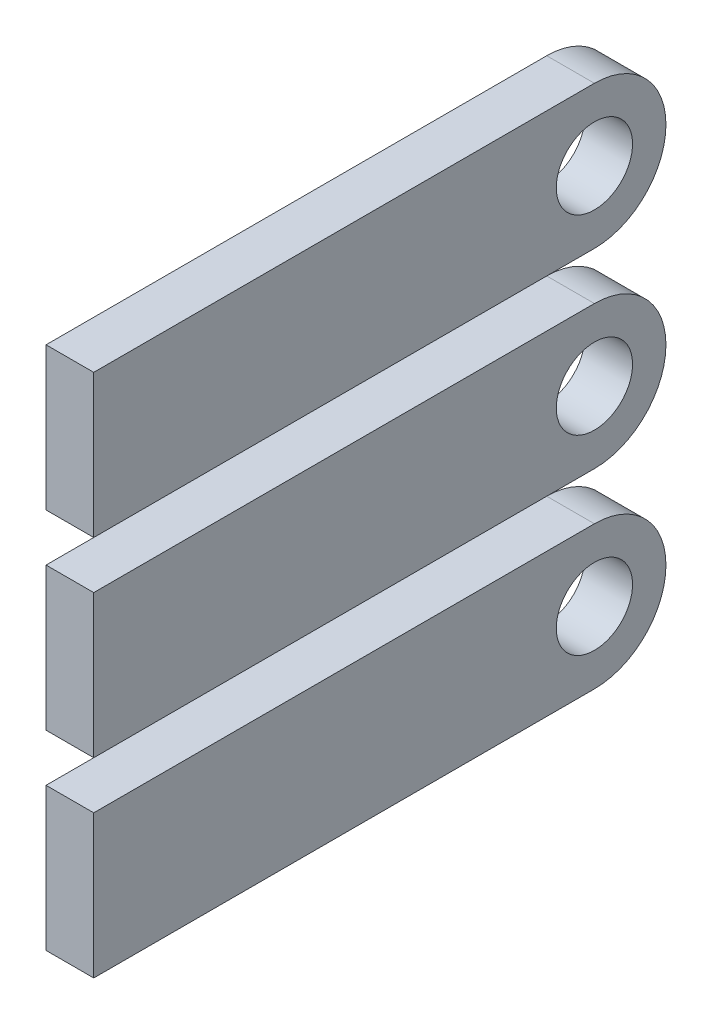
from build123d import *

# Parameters (mm, degrees)
P_IDAT_VYSUNUT_M1_DEPTH  = 85
SKICA2_R                 = 105
SKICA2_R_2               = 80.422447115
P_IDAT_VYSUNUT_M2_DEPTH  = 20
SKICA4_W                 = 5
SKICA4_H                 = 15
P_IDAT_VYSUNUT_M3_DEPTH  = 60
ODEBRAT_VYSUNUT_M2_DEPTH = 80
LINPOLE3_COUNT           = 3
LINPOLE3_PITCH           = 20
ODEBRAT_VYSUNUT_M3_DEPTH = 80
ODEBRAT_VYSUNUT_M4_DEPTH = 80
M_TKO1_SCALE             = 0.655
SKICA12_R                = 90.665078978
ODEBRAT_VYSUNUT_M5_DEPTH = 120.121794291


with BuildPart() as part:
    # Skica1 → P_idat vysunut_m1 (new body)
    with BuildSketch(Plane.XY):
        Polygon((-85.128854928, 24.715947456), (-77.052076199, 23.037958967), (-75.877811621, 26.651973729), (-83.39835976, 30.041863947), align=None)
        Polygon((-82.078990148, 33.478939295), (-74.221854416, 30.965889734), (-72.676255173, 34.437362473), (-79.801264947, 38.594793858), align=None)
        Polygon((-78.129850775, 41.875128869), (-70.578442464, 38.554551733), (-68.678442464, 41.845448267), (-75.329850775, 46.724871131), align=None)
        Polygon((-73.324704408, 49.812525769), (-66.161758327, 45.720801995), (-63.928174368, 48.795066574), (-70.033106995, 54.343020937), align=None)
        Polygon((-67.716197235, 57.204166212), (-61.02019212, 52.386125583), (-58.477495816, 55.21007592), (-63.969065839, 61.365777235), align=None)
        Polygon((-61.365777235, 63.969065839), (-55.21007592, 58.477495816), (-52.386125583, 61.02019212), (-57.204166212, 67.716197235), align=None)
        Polygon((-54.343020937, 70.033106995), (-48.795066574, 63.928174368), (-45.720801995, 66.161758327), (-49.812525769, 73.324704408), align=None)
        Polygon((-46.724871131, 75.329850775), (-41.845448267, 68.678442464), (-38.554551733, 70.578442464), (-41.875128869, 78.129850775), align=None)
        Polygon((-38.594793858, 79.801264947), (-34.437362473, 72.676255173), (-30.965889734, 74.221854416), (-33.478939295, 82.078990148), align=None)
        Polygon((-30.041863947, 83.39835976), (-26.651973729, 75.877811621), (-23.037958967, 77.052076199), (-24.715947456, 85.128854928), align=None)
        Polygon((-21.159789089, 86.081724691), (-18.574580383, 78.248034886), (-14.8576195, 79.038099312), (-15.682162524, 87.246030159), align=None)
        Polygon((-12.045883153, 87.821960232), (-10.293680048, 79.760956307), (-6.514496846, 80.158164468), (-6.476560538, 88.407319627), align=None)
        Polygon((-87.246030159, 15.682162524), (-79.038099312, 14.8576195), (-78.248034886, 18.574580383), (-86.081724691, 21.159789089), align=None)
        Polygon((-88.407319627, 6.476560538), (-80.158164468, 6.514496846), (-79.760956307, 10.293680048), (-87.821960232, 12.045883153), align=None)
        Polygon((-87.821960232, -12.045883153), (-79.760956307, -10.293680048), (-80.158164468, -6.514496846), (-88.407319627, -6.476560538), align=None)
        Polygon((-83.39835976, -30.041863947), (-75.877811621, -26.651973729), (-77.052076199, -23.037958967), (-85.128854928, -24.715947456), align=None)
        Polygon((-88.6, -2.8), (-80.4, -1.9), (-80.4, 1.9), (-88.6, 2.8), align=None)
        Polygon((-79.801264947, -38.594793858), (-72.676255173, -34.437362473), (-74.221854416, -30.965889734), (-82.078990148, -33.478939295), align=None)
        Polygon((-75.329850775, -46.724871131), (-68.678442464, -41.845448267), (-70.578442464, -38.554551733), (-78.129850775, -41.875128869), align=None)
        Polygon((-70.033106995, -54.343020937), (-63.928174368, -48.795066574), (-66.161758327, -45.720801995), (-73.324704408, -49.812525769), align=None)
        Polygon((-63.969065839, -61.365777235), (-58.477495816, -55.21007592), (-61.02019212, -52.386125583), (-67.716197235, -57.204166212), align=None)
        Polygon((-57.204166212, -67.716197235), (-52.386125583, -61.02019212), (-55.21007592, -58.477495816), (-61.365777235, -63.969065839), align=None)
        Polygon((-54.343020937, -70.033106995), (-48.795066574, -63.928174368), (-45.720801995, -66.161758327), (-49.812525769, -73.324704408), align=None)
        Polygon((-46.724871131, -75.329850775), (-41.845448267, -68.678442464), (-38.554551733, -70.578442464), (-41.875128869, -78.129850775), align=None)
        Polygon((-38.594793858, -79.801264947), (-34.437362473, -72.676255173), (-30.965889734, -74.221854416), (-33.478939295, -82.078990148), align=None)
        Polygon((-30.041863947, -83.39835976), (-26.651973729, -75.877811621), (-23.037958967, -77.052076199), (-24.715947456, -85.128854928), align=None)
        Polygon((-21.159789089, -86.081724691), (-18.574580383, -78.248034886), (-14.8576195, -79.038099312), (-15.682162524, -87.246030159), align=None)
        Polygon((-12.045883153, -87.821960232), (-10.293680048, -79.760956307), (-6.514496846, -80.158164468), (-6.476560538, -88.407319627), align=None)
        Polygon((-2.8, -88.6), (-1.9, -80.4), (1.9, -80.4), (2.8, -88.6), align=None)
        Polygon((6.476560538, -88.407319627), (6.514496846, -80.158164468), (10.293680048, -79.760956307), (12.045883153, -87.821960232), align=None)
        Polygon((15.682162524, -87.246030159), (14.8576195, -79.038099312), (18.574580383, -78.248034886), (21.159789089, -86.081724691), align=None)
        Polygon((24.715947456, -85.128854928), (23.037958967, -77.052076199), (26.651973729, -75.877811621), (30.041863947, -83.39835976), align=None)
        Polygon((33.478939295, -82.078990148), (30.965889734, -74.221854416), (34.437362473, -72.676255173), (38.594793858, -79.801264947), align=None)
        Polygon((41.875128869, -78.129850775), (38.554551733, -70.578442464), (41.845448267, -68.678442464), (46.724871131, -75.329850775), align=None)
        Polygon((49.812525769, -73.324704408), (45.720801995, -66.161758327), (48.795066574, -63.928174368), (54.343020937, -70.033106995), align=None)
        Polygon((57.204166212, -67.716197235), (52.386125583, -61.02019212), (55.21007592, -58.477495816), (61.365777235, -63.969065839), align=None)
        Polygon((63.969065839, -61.365777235), (58.477495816, -55.21007592), (61.02019212, -52.386125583), (67.716197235, -57.204166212), align=None)
        Polygon((70.033106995, -54.343020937), (63.928174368, -48.795066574), (66.161758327, -45.720801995), (73.324704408, -49.812525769), align=None)
        Polygon((75.329850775, -46.724871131), (68.678442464, -41.845448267), (70.578442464, -38.554551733), (78.129850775, -41.875128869), align=None)
        Polygon((79.801264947, -38.594793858), (72.676255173, -34.437362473), (74.221854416, -30.965889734), (82.078990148, -33.478939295), align=None)
        Polygon((83.39835976, -30.041863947), (75.877811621, -26.651973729), (77.052076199, -23.037958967), (85.128854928, -24.715947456), align=None)
        Polygon((86.081724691, -21.159789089), (78.248034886, -18.574580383), (79.038099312, -14.8576195), (87.246030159, -15.682162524), align=None)
        Polygon((87.821960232, -12.045883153), (79.760956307, -10.293680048), (80.158164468, -6.514496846), (88.407319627, -6.476560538), align=None)
        Polygon((88.6, -2.8), (80.4, -1.9), (80.4, 1.9), (88.6, 2.8), align=None)
        Polygon((88.407319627, 6.476560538), (80.158164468, 6.514496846), (79.760956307, 10.293680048), (87.821960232, 12.045883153), align=None)
        Polygon((87.246030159, 15.682162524), (79.038099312, 14.8576195), (78.248034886, 18.574580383), (86.081724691, 21.159789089), align=None)
        Polygon((85.128854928, 24.715947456), (77.052076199, 23.037958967), (75.877811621, 26.651973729), (83.39835976, 30.041863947), align=None)
        Polygon((82.078990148, 33.478939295), (74.221854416, 30.965889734), (72.676255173, 34.437362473), (79.801264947, 38.594793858), align=None)
        Polygon((78.129850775, 41.875128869), (70.578442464, 38.554551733), (68.678442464, 41.845448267), (75.329850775, 46.724871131), align=None)
        Polygon((73.324704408, 49.812525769), (66.161758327, 45.720801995), (63.928174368, 48.795066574), (70.033106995, 54.343020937), align=None)
        Polygon((67.716197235, 57.204166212), (61.02019212, 52.386125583), (58.477495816, 55.21007592), (63.969065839, 61.365777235), align=None)
        Polygon((61.365777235, 63.969065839), (55.21007592, 58.477495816), (52.386125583, 61.02019212), (57.204166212, 67.716197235), align=None)
        Polygon((54.343020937, 70.033106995), (48.795066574, 63.928174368), (45.720801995, 66.161758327), (49.812525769, 73.324704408), align=None)
        Polygon((46.724871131, 75.329850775), (41.845448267, 68.678442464), (38.554551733, 70.578442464), (41.875128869, 78.129850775), align=None)
        Polygon((38.594793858, 79.801264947), (34.437362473, 72.676255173), (30.965889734, 74.221854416), (33.478939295, 82.078990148), align=None)
        Polygon((30.041863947, 83.39835976), (26.651973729, 75.877811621), (23.037958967, 77.052076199), (24.715947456, 85.128854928), align=None)
        Polygon((21.159789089, 86.081724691), (18.574580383, 78.248034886), (14.8576195, 79.038099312), (15.682162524, 87.246030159), align=None)
        Polygon((12.045883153, 87.821960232), (10.293680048, 79.760956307), (6.514496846, 80.158164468), (6.476560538, 88.407319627), align=None)
        Polygon((0, 80.4), (1.9, 80.4), (2.8, 88.6), (0, 88.6), align=None)
        Polygon((-1.9, 80.4), (0, 80.4), (0, 88.6), (-2.8, 88.6), align=None)
        Polygon((-86.081724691, -21.159789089), (-87.246030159, -15.682162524), (-79.038099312, -14.8576195), (-78.347254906, -15.221946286), (-77.765102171, -17.960759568), (-78.248034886, -18.574580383), align=None)
    extrude(amount=P_IDAT_VYSUNUT_M1_DEPTH)

    # Skica2 → P_idat vysunut_m2 (add)
    with BuildSketch(Plane.XY):
        Circle(SKICA2_R)
        Circle(SKICA2_R_2, mode=Mode.SUBTRACT)
    extrude(amount=-P_IDAT_VYSUNUT_M2_DEPTH)

    # Skica4 → P_idat vysunut_m3 (add)
    with BuildSketch(Plane(origin=(0, 0, -20), x_dir=(-1, 0, 0), z_dir=(0, 0, -1))):
        with Locations((-94, 19.997523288)):
            Rectangle(SKICA4_W, SKICA4_H)
    p_idat_vysunut_m3 = extrude(amount=P_IDAT_VYSUNUT_M3_DEPTH)

    # Skica5 → Odebrat vysunut_m2 (cut)
    with BuildSketch(Plane.ZY.offset(-91.5)):
        with BuildLine():
            Line((-80, 27.497523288), (-80, 19.997523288))
            ThreePointArc((-80, 19.997523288), (-77.803300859, 25.300824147), (-72.5, 27.497523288))
            Line((-72.5, 27.497523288), (-80, 27.497523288))
        make_face()
        with BuildLine():
            ThreePointArc((-72.5, 12.497523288), (-77.803300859, 14.694222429), (-80, 19.997523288))
            Line((-80, 19.997523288), (-80, 12.497523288))
            Line((-80, 12.497523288), (-72.5, 12.497523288))
        make_face()
        with BuildLine():
            ThreePointArc((-72.5, 23.997523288), (-75.328427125, 22.825950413), (-76.5, 19.997523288))
            Line((-76.5, 19.997523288), (-72.5, 19.997523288))
            Line((-72.5, 19.997523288), (-72.5, 23.997523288))
        make_face()
        with BuildLine():
            Line((-72.5, 19.997523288), (-76.5, 19.997523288))
            ThreePointArc((-76.5, 19.997523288), (-75.328427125, 17.169096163), (-72.5, 15.997523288))
            Line((-72.5, 15.997523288), (-72.5, 19.997523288))
        make_face()
        with BuildLine():
            ThreePointArc((-72.5, 23.997523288), (-75.328427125, 22.825950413), (-76.5, 19.997523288))
            Line((-76.5, 19.997523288), (-72.5, 19.997523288))
            Line((-72.5, 19.997523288), (-72.5, 23.997523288))
        make_face()
        with BuildLine():
            Line((-72.5, 19.997523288), (-76.5, 19.997523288))
            ThreePointArc((-76.5, 19.997523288), (-75.328427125, 17.169096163), (-72.5, 15.997523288))
            Line((-72.5, 15.997523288), (-72.5, 19.997523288))
        make_face()
        with BuildLine():
            Line((-72.5, 23.997523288), (-72.5, 19.997523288))
            Line((-72.5, 19.997523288), (-72.5, 15.997523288))
            ThreePointArc((-72.5, 15.997523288), (-69.671572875, 17.169096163), (-68.5, 19.997523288))
            ThreePointArc((-68.5, 19.997523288), (-69.671572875, 22.825950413), (-72.5, 23.997523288))
        make_face()
    extrude(amount=-ODEBRAT_VYSUNUT_M2_DEPTH, mode=Mode.SUBTRACT)

    # LinPole3: P_idat vysunut_m3 ×3
    with Locations(*[(0, -i * LINPOLE3_PITCH, 0) for i in range(1, LINPOLE3_COUNT)]):
        add(p_idat_vysunut_m3)

    # Skica8 → Odebrat vysunut_m3 (cut)
    with BuildSketch(Plane.ZY.offset(-91.5)):
        with BuildLine():
            Line((-80, 7.497523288), (-80, -0.002476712))
            ThreePointArc((-80, -0.002476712), (-77.803300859, 5.300824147), (-72.5, 7.497523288))
            Line((-72.5, 7.497523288), (-80, 7.497523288))
        make_face()
        with BuildLine():
            ThreePointArc((-72.5, -7.502476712), (-77.803300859, -5.305777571), (-80, -0.002476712))
            Line((-80, -0.002476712), (-80, -7.502476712))
            Line((-80, -7.502476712), (-72.5, -7.502476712))
        make_face()
        with BuildLine():
            ThreePointArc((-72.5, 3.997523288), (-75.328427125, 2.825950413), (-76.5, -0.002476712))
            Line((-76.5, -0.002476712), (-72.5, -0.002476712))
            Line((-72.5, -0.002476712), (-72.5, 3.997523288))
        make_face()
        with BuildLine():
            Line((-72.5, -0.002476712), (-76.5, -0.002476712))
            ThreePointArc((-76.5, -0.002476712), (-75.328427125, -2.830903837), (-72.5, -4.002476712))
            Line((-72.5, -4.002476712), (-72.5, -0.002476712))
        make_face()
        with BuildLine():
            ThreePointArc((-72.5, 3.997523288), (-75.328427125, 2.825950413), (-76.5, -0.002476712))
            Line((-76.5, -0.002476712), (-72.5, -0.002476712))
            Line((-72.5, -0.002476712), (-72.5, 3.997523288))
        make_face()
        with BuildLine():
            Line((-72.5, -0.002476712), (-76.5, -0.002476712))
            ThreePointArc((-76.5, -0.002476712), (-75.328427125, -2.830903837), (-72.5, -4.002476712))
            Line((-72.5, -4.002476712), (-72.5, -0.002476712))
        make_face()
        with BuildLine():
            Line((-72.5, 3.997523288), (-72.5, -0.002476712))
            Line((-72.5, -0.002476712), (-72.5, -4.002476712))
            ThreePointArc((-72.5, -4.002476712), (-69.671572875, -2.830903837), (-68.5, -0.002476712))
            ThreePointArc((-68.5, -0.002476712), (-69.671572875, 2.825950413), (-72.5, 3.997523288))
        make_face()
    extrude(amount=-ODEBRAT_VYSUNUT_M3_DEPTH, mode=Mode.SUBTRACT)

    # Skica9 → Odebrat vysunut_m4 (cut)
    with BuildSketch(Plane.ZY.offset(-91.5)):
        with BuildLine():
            Line((-80, -12.502476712), (-80, -20.002476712))
            ThreePointArc((-80, -20.002476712), (-77.803300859, -14.699175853), (-72.5, -12.502476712))
            Line((-72.5, -12.502476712), (-80, -12.502476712))
        make_face()
        with BuildLine():
            ThreePointArc((-72.5, -27.502476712), (-77.803300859, -25.305777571), (-80, -20.002476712))
            Line((-80, -20.002476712), (-80, -27.502476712))
            Line((-80, -27.502476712), (-72.5, -27.502476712))
        make_face()
        with BuildLine():
            ThreePointArc((-72.5, -16.002476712), (-75.328427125, -17.174049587), (-76.5, -20.002476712))
            Line((-76.5, -20.002476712), (-72.5, -20.002476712))
            Line((-72.5, -20.002476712), (-72.5, -16.002476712))
        make_face()
        with BuildLine():
            Line((-72.5, -20.002476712), (-76.5, -20.002476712))
            ThreePointArc((-76.5, -20.002476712), (-75.328427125, -22.830903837), (-72.5, -24.002476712))
            Line((-72.5, -24.002476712), (-72.5, -20.002476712))
        make_face()
        with BuildLine():
            Line((-72.5, -16.002476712), (-72.5, -20.002476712))
            Line((-72.5, -20.002476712), (-72.5, -24.002476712))
            ThreePointArc((-72.5, -24.002476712), (-69.671572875, -22.830903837), (-68.5, -20.002476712))
            ThreePointArc((-68.5, -20.002476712), (-69.671572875, -17.174049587), (-72.5, -16.002476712))
        make_face()
        with BuildLine():
            ThreePointArc((-72.5, -16.002476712), (-75.328427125, -17.174049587), (-76.5, -20.002476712))
            Line((-76.5, -20.002476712), (-72.5, -20.002476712))
            Line((-72.5, -20.002476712), (-72.5, -16.002476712))
        make_face()
        with BuildLine():
            Line((-72.5, -20.002476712), (-76.5, -20.002476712))
            ThreePointArc((-76.5, -20.002476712), (-75.328427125, -22.830903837), (-72.5, -24.002476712))
            Line((-72.5, -24.002476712), (-72.5, -20.002476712))
        make_face()
    extrude(amount=-ODEBRAT_VYSUNUT_M4_DEPTH, mode=Mode.SUBTRACT)


with BuildPart() as part_1:
    # M_tko1: scaled about (0, 0, 0)
    add(part.part.scale(M_TKO1_SCALE))

    # Skica12 → Odebrat vysunut_m5 (cut, through all)
    with BuildSketch(Plane(origin=(0, 0, -13.1), x_dir=(-1, 0, 0), z_dir=(0, 0, -1))):
        Circle(SKICA12_R)
    extrude(amount=-ODEBRAT_VYSUNUT_M5_DEPTH, mode=Mode.SUBTRACT)


with BuildPart() as odebrat_vysunut_m5_piece_1:
    # of the separate pieces the step leaves, piece 1, a body of its own (odebrat_vysunut_m5_pieces)
    add(part_1.part.solids().sort_by_distance((63.2075, 18.010877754, -13.1))[0])


with BuildPart() as odebrat_vysunut_m5_piece_2:
    # of the separate pieces the step leaves, piece 2, a body of its own (odebrat_vysunut_m5_pieces)
    add(part_1.part.solids().sort_by_distance((63.2075, 4.910877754, -13.1))[0])


with BuildPart() as odebrat_vysunut_m5_piece_3:
    # of the separate pieces the step leaves, piece 3, a body of its own (odebrat_vysunut_m5_pieces)
    add(part_1.part.solids().sort_by_distance((63.2075, -8.189122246, -13.1))[0])


solid = Compound([odebrat_vysunut_m5_piece_1.part, odebrat_vysunut_m5_piece_2.part, odebrat_vysunut_m5_piece_3.part])
